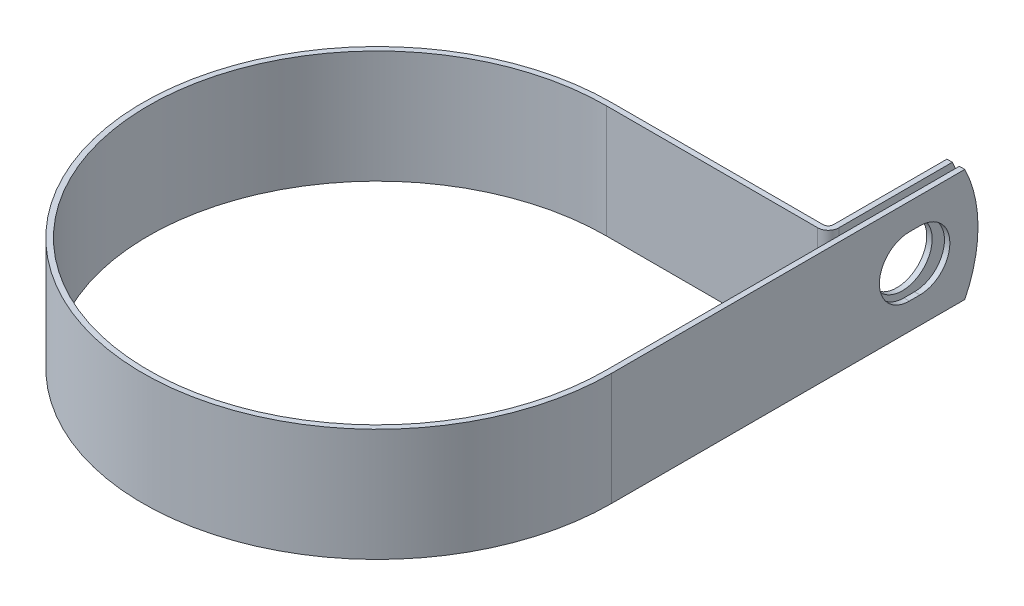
ISO-10303-21;
HEADER;
FILE_DESCRIPTION(('STEP AP214'),'2;1');
FILE_NAME('part.step','',(''),(''),'','','');
FILE_SCHEMA(('AUTOMOTIVE_DESIGN { 1 0 10303 214 1 1 1 1 }'));
ENDSEC;
DATA;
#1=APPLICATION_CONTEXT('core data for automotive mechanical design processes');
#2=APPLICATION_PROTOCOL_DEFINITION('international standard','automotive_design',2000,#1);
#3=PRODUCT_CONTEXT('',#1,'mechanical');
#4=PRODUCT('Part','Part','',(#3));
#5=PRODUCT_RELATED_PRODUCT_CATEGORY('part','',(#4));
#6=PRODUCT_DEFINITION_FORMATION('','',#4);
#7=PRODUCT_DEFINITION_CONTEXT('part definition',#1,'design');
#8=PRODUCT_DEFINITION('design','',#6,#7);
#9=PRODUCT_DEFINITION_SHAPE('','',#8);
#10=(LENGTH_UNIT() NAMED_UNIT(*) SI_UNIT(.MILLI.,.METRE.));
#11=(NAMED_UNIT(*) PLANE_ANGLE_UNIT() SI_UNIT($,.RADIAN.));
#12=(NAMED_UNIT(*) SI_UNIT($,.STERADIAN.) SOLID_ANGLE_UNIT());
#13=UNCERTAINTY_MEASURE_WITH_UNIT(LENGTH_MEASURE(1.E-05),#10,'distance_accuracy_value','');
#14=(GEOMETRIC_REPRESENTATION_CONTEXT(3) GLOBAL_UNCERTAINTY_ASSIGNED_CONTEXT((#13)) GLOBAL_UNIT_ASSIGNED_CONTEXT((#10,
#11,#12)) REPRESENTATION_CONTEXT('',''));
#15=CARTESIAN_POINT('',(0.,0.,0.));
#16=DIRECTION('',(0.,0.,1.));
#17=DIRECTION('',(1.,0.,0.));
#18=AXIS2_PLACEMENT_3D('',#15,#16,#17);
#19=CARTESIAN_POINT('',(51.5874,12.7,0.));
#20=DIRECTION('',(-1.,0.,0.));
#21=DIRECTION('',(0.,0.,1.));
#22=AXIS2_PLACEMENT_3D('',#19,#20,#21);
#23=PLANE('',#22);
#24=DIRECTION('',(0.,0.,-1.));
#25=VECTOR('',#24,1.);
#26=CARTESIAN_POINT('',(51.5874,-6.7437,-67.0559999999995));
#27=LINE('',#26,#25);
#28=CARTESIAN_POINT('',(51.5874,-6.7437,-67.0559999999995));
#29=VERTEX_POINT('',#28);
#30=CARTESIAN_POINT('',(51.5874,-6.7437,-69.4436000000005));
#31=VERTEX_POINT('',#30);
#32=EDGE_CURVE('E218',#29,#31,#27,.T.);
#33=ORIENTED_EDGE('',*,*,#32,.T.);
#34=CARTESIAN_POINT('',(51.5874,0.,-69.4435999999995));
#35=DIRECTION('',(-1.,0.,0.));
#36=DIRECTION('',(0.,0.,1.));
#37=AXIS2_PLACEMENT_3D('',#34,#35,#36);
#38=CIRCLE('',#37,6.7437);
#39=CARTESIAN_POINT('',(51.5874,6.7437,-69.4436000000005));
#40=VERTEX_POINT('',#39);
#41=EDGE_CURVE('E239',#31,#40,#38,.F.);
#42=ORIENTED_EDGE('',*,*,#41,.T.);
#43=DIRECTION('',(0.,0.,1.));
#44=VECTOR('',#43,1.);
#45=CARTESIAN_POINT('',(51.5874,6.7437,-67.0559999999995));
#46=LINE('',#45,#44);
#47=CARTESIAN_POINT('',(51.5874,6.7437,-67.0559999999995));
#48=VERTEX_POINT('',#47);
#49=EDGE_CURVE('E235',#40,#48,#46,.T.);
#50=ORIENTED_EDGE('',*,*,#49,.T.);
#51=CARTESIAN_POINT('',(51.5874,0.,-67.0559999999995));
#52=DIRECTION('',(-1.,0.,0.));
#53=DIRECTION('',(0.,0.,1.));
#54=AXIS2_PLACEMENT_3D('',#51,#52,#53);
#55=CIRCLE('',#54,6.7437);
#56=EDGE_CURVE('E230',#48,#29,#55,.F.);
#57=ORIENTED_EDGE('',*,*,#56,.T.);
#58=EDGE_LOOP('',(#33,#42,#50,#57));
#59=FACE_BOUND('',#58,.T.);
#60=CARTESIAN_POINT('',(51.5874,0.,-53.9496));
#61=DIRECTION('',(-1.,0.,0.));
#62=DIRECTION('',(0.,0.,1.));
#63=AXIS2_PLACEMENT_3D('',#60,#61,#62);
#64=CIRCLE('',#63,28.575);
#65=CARTESIAN_POINT('',(51.5874,12.7,-79.5472683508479));
#66=VERTEX_POINT('',#65);
#67=CARTESIAN_POINT('',(51.5874,-12.7,-79.5472683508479));
#68=VERTEX_POINT('',#67);
#69=EDGE_CURVE('E57',#66,#68,#64,.T.);
#70=ORIENTED_EDGE('',*,*,#69,.T.);
#71=DIRECTION('',(0.,0.,-1.));
#72=VECTOR('',#71,1.);
#73=CARTESIAN_POINT('',(51.5874,-12.7,0.));
#74=LINE('',#73,#72);
#75=CARTESIAN_POINT('',(51.5874,-12.7,0.));
#76=VERTEX_POINT('',#75);
#77=EDGE_CURVE('E253',#76,#68,#74,.T.);
#78=ORIENTED_EDGE('',*,*,#77,.F.);
#79=DIRECTION('',(0.,-1.,0.));
#80=VECTOR('',#79,1.);
#81=CARTESIAN_POINT('',(51.5874,12.7,0.));
#82=LINE('',#81,#80);
#83=CARTESIAN_POINT('',(51.5874,12.7,0.));
#84=VERTEX_POINT('',#83);
#85=EDGE_CURVE('E200',#84,#76,#82,.T.);
#86=ORIENTED_EDGE('',*,*,#85,.F.);
#87=DIRECTION('',(0.,0.,-1.));
#88=VECTOR('',#87,1.);
#89=CARTESIAN_POINT('',(51.5874,12.7,-51.5874));
#90=LINE('',#89,#88);
#91=EDGE_CURVE('E255',#84,#66,#90,.T.);
#92=ORIENTED_EDGE('',*,*,#91,.T.);
#93=EDGE_LOOP('',(#70,#78,#86,#92));
#94=FACE_BOUND('',#93,.T.);
#95=ADVANCED_FACE('F36',(#59,#94),#23,.T.);
#96=CARTESIAN_POINT('',(50.0126,12.7,-82.5246));
#97=DIRECTION('',(1.,0.,0.));
#98=DIRECTION('',(0.,0.,-1.));
#99=AXIS2_PLACEMENT_3D('',#96,#97,#98);
#100=PLANE('',#99);
#101=CARTESIAN_POINT('',(50.0126,0.,-68.2498));
#102=DIRECTION('',(1.,0.,0.));
#103=DIRECTION('',(0.,0.,-1.));
#104=AXIS2_PLACEMENT_3D('',#101,#102,#103);
#105=CIRCLE('',#104,6.7437);
#106=CARTESIAN_POINT('',(50.0126,0.,-61.5061));
#107=VERTEX_POINT('',#106);
#108=EDGE_CURVE('E250',#107,#107,#105,.F.);
#109=ORIENTED_EDGE('',*,*,#108,.T.);
#110=EDGE_LOOP('',(#109));
#111=FACE_BOUND('',#110,.T.);
#112=DIRECTION('',(0.,0.,1.));
#113=VECTOR('',#112,1.);
#114=CARTESIAN_POINT('',(50.0126,-12.7,-82.5246));
#115=LINE('',#114,#113);
#116=CARTESIAN_POINT('',(50.0126,-12.7,-79.5472683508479));
#117=VERTEX_POINT('',#116);
#118=CARTESIAN_POINT('',(50.0126,-12.7,-53.96484));
#119=VERTEX_POINT('',#118);
#120=EDGE_CURVE('E166',#117,#119,#115,.T.);
#121=ORIENTED_EDGE('',*,*,#120,.F.);
#122=CARTESIAN_POINT('',(50.0126,0.,-53.9496));
#123=DIRECTION('',(1.,0.,0.));
#124=DIRECTION('',(0.,0.,-1.));
#125=AXIS2_PLACEMENT_3D('',#122,#123,#124);
#126=CIRCLE('',#125,28.575);
#127=CARTESIAN_POINT('',(50.0126,12.7,-79.5472683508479));
#128=VERTEX_POINT('',#127);
#129=EDGE_CURVE('E158',#117,#128,#126,.T.);
#130=ORIENTED_EDGE('',*,*,#129,.T.);
#131=DIRECTION('',(0.,0.,1.));
#132=VECTOR('',#131,1.);
#133=CARTESIAN_POINT('',(50.0126,12.7,-82.5246));
#134=LINE('',#133,#132);
#135=CARTESIAN_POINT('',(50.0126,12.7,-53.96484));
#136=VERTEX_POINT('',#135);
#137=EDGE_CURVE('E206',#128,#136,#134,.T.);
#138=ORIENTED_EDGE('',*,*,#137,.T.);
#139=DIRECTION('',(0.,-1.,0.));
#140=VECTOR('',#139,1.);
#141=CARTESIAN_POINT('',(50.0126,12.7,-53.96484));
#142=LINE('',#141,#140);
#143=EDGE_CURVE('E193',#136,#119,#142,.T.);
#144=ORIENTED_EDGE('',*,*,#143,.T.);
#145=EDGE_LOOP('',(#121,#130,#138,#144));
#146=FACE_BOUND('',#145,.T.);
#147=ADVANCED_FACE('F208',(#111,#146),#100,.T.);
#148=CARTESIAN_POINT('',(48.7934,12.7,-82.5246));
#149=DIRECTION('',(1.,0.,0.));
#150=DIRECTION('',(0.,0.,-1.));
#151=AXIS2_PLACEMENT_3D('',#148,#149,#150);
#152=PLANE('',#151);
#153=CARTESIAN_POINT('',(48.7934,0.,-68.2498));
#154=DIRECTION('',(-1.,0.,0.));
#155=DIRECTION('',(0.,0.,1.));
#156=AXIS2_PLACEMENT_3D('',#153,#154,#155);
#157=CIRCLE('',#156,6.7437);
#158=CARTESIAN_POINT('',(48.7934,0.,-61.5061));
#159=VERTEX_POINT('',#158);
#160=EDGE_CURVE('E247',#159,#159,#157,.T.);
#161=ORIENTED_EDGE('',*,*,#160,.F.);
#162=EDGE_LOOP('',(#161));
#163=FACE_BOUND('',#162,.T.);
#164=CARTESIAN_POINT('',(48.7934,0.,-53.9496));
#165=DIRECTION('',(-1.,0.,0.));
#166=DIRECTION('',(0.,0.,1.));
#167=AXIS2_PLACEMENT_3D('',#164,#165,#166);
#168=CIRCLE('',#167,28.575);
#169=CARTESIAN_POINT('',(48.7934,12.7,-79.5472683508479));
#170=VERTEX_POINT('',#169);
#171=CARTESIAN_POINT('',(48.7934,-12.7,-79.5472683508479));
#172=VERTEX_POINT('',#171);
#173=EDGE_CURVE('E49',#170,#172,#168,.T.);
#174=ORIENTED_EDGE('',*,*,#173,.T.);
#175=DIRECTION('',(0.,0.,1.));
#176=VECTOR('',#175,1.);
#177=CARTESIAN_POINT('',(48.7934,-12.7,-82.5246));
#178=LINE('',#177,#176);
#179=CARTESIAN_POINT('',(48.7934,-12.7,-53.96484));
#180=VERTEX_POINT('',#179);
#181=EDGE_CURVE('E149',#172,#180,#178,.T.);
#182=ORIENTED_EDGE('',*,*,#181,.T.);
#183=DIRECTION('',(0.,-1.,0.));
#184=VECTOR('',#183,1.);
#185=CARTESIAN_POINT('',(48.7934,12.7,-53.96484));
#186=LINE('',#185,#184);
#187=CARTESIAN_POINT('',(48.7934,12.7,-53.96484));
#188=VERTEX_POINT('',#187);
#189=EDGE_CURVE('E191',#188,#180,#186,.T.);
#190=ORIENTED_EDGE('',*,*,#189,.F.);
#191=DIRECTION('',(0.,0.,1.));
#192=VECTOR('',#191,1.);
#193=CARTESIAN_POINT('',(48.7934,12.7,-82.5246));
#194=LINE('',#193,#192);
#195=EDGE_CURVE('E151',#170,#188,#194,.T.);
#196=ORIENTED_EDGE('',*,*,#195,.F.);
#197=EDGE_LOOP('',(#174,#182,#190,#196));
#198=FACE_BOUND('',#197,.T.);
#199=ADVANCED_FACE('F146',(#163,#198),#152,.F.);
#200=CARTESIAN_POINT('',(52.8066,12.7,0.));
#201=DIRECTION('',(-1.,0.,0.));
#202=DIRECTION('',(0.,0.,1.));
#203=AXIS2_PLACEMENT_3D('',#200,#201,#202);
#204=PLANE('',#203);
#205=CARTESIAN_POINT('',(52.8066,0.,-69.4435999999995));
#206=DIRECTION('',(1.,0.,0.));
#207=DIRECTION('',(0.,0.,-1.));
#208=AXIS2_PLACEMENT_3D('',#205,#206,#207);
#209=CIRCLE('',#208,6.7437);
#210=CARTESIAN_POINT('',(52.8066,-6.7437,-69.4436000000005));
#211=VERTEX_POINT('',#210);
#212=CARTESIAN_POINT('',(52.8066,6.7437,-69.4436000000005));
#213=VERTEX_POINT('',#212);
#214=EDGE_CURVE('E219',#211,#213,#209,.T.);
#215=ORIENTED_EDGE('',*,*,#214,.F.);
#216=DIRECTION('',(0.,0.,-1.));
#217=VECTOR('',#216,1.);
#218=CARTESIAN_POINT('',(52.8066,-6.7437,-67.0559999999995));
#219=LINE('',#218,#217);
#220=CARTESIAN_POINT('',(52.8066,-6.7437,-67.0559999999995));
#221=VERTEX_POINT('',#220);
#222=EDGE_CURVE('E222',#221,#211,#219,.T.);
#223=ORIENTED_EDGE('',*,*,#222,.F.);
#224=CARTESIAN_POINT('',(52.8066,0.,-67.0559999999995));
#225=DIRECTION('',(1.,0.,0.));
#226=DIRECTION('',(0.,0.,-1.));
#227=AXIS2_PLACEMENT_3D('',#224,#225,#226);
#228=CIRCLE('',#227,6.7437);
#229=CARTESIAN_POINT('',(52.8066,6.7437,-67.0559999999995));
#230=VERTEX_POINT('',#229);
#231=EDGE_CURVE('E212',#230,#221,#228,.T.);
#232=ORIENTED_EDGE('',*,*,#231,.F.);
#233=DIRECTION('',(0.,0.,1.));
#234=VECTOR('',#233,1.);
#235=CARTESIAN_POINT('',(52.8066,6.7437,-67.0559999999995));
#236=LINE('',#235,#234);
#237=EDGE_CURVE('E216',#213,#230,#236,.T.);
#238=ORIENTED_EDGE('',*,*,#237,.F.);
#239=EDGE_LOOP('',(#215,#223,#232,#238));
#240=FACE_BOUND('',#239,.T.);
#241=DIRECTION('',(0.,0.,-1.));
#242=VECTOR('',#241,1.);
#243=CARTESIAN_POINT('',(52.8066,-12.7,0.));
#244=LINE('',#243,#242);
#245=CARTESIAN_POINT('',(52.8066,-12.7,0.));
#246=VERTEX_POINT('',#245);
#247=CARTESIAN_POINT('',(52.8066,-12.7,-79.5472683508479));
#248=VERTEX_POINT('',#247);
#249=EDGE_CURVE('E177',#246,#248,#244,.T.);
#250=ORIENTED_EDGE('',*,*,#249,.T.);
#251=CARTESIAN_POINT('',(52.8066,0.,-53.9496));
#252=DIRECTION('',(-1.,0.,0.));
#253=DIRECTION('',(0.,0.,1.));
#254=AXIS2_PLACEMENT_3D('',#251,#252,#253);
#255=CIRCLE('',#254,28.575);
#256=CARTESIAN_POINT('',(52.8066,12.7,-79.5472683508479));
#257=VERTEX_POINT('',#256);
#258=EDGE_CURVE('E152',#257,#248,#255,.T.);
#259=ORIENTED_EDGE('',*,*,#258,.F.);
#260=DIRECTION('',(0.,0.,-1.));
#261=VECTOR('',#260,1.);
#262=CARTESIAN_POINT('',(52.8066,12.7,-51.5874));
#263=LINE('',#262,#261);
#264=CARTESIAN_POINT('',(52.8066,12.7,0.));
#265=VERTEX_POINT('',#264);
#266=EDGE_CURVE('E180',#265,#257,#263,.T.);
#267=ORIENTED_EDGE('',*,*,#266,.F.);
#268=DIRECTION('',(0.,-1.,0.));
#269=VECTOR('',#268,1.);
#270=CARTESIAN_POINT('',(52.8066,12.7,0.));
#271=LINE('',#270,#269);
#272=EDGE_CURVE('E181',#265,#246,#271,.T.);
#273=ORIENTED_EDGE('',*,*,#272,.T.);
#274=EDGE_LOOP('',(#250,#259,#267,#273));
#275=FACE_BOUND('',#274,.T.);
#276=ADVANCED_FACE('F303',(#240,#275),#204,.F.);
#277=CARTESIAN_POINT('',(0.,-12.7,0.));
#278=DIRECTION('',(0.,1.,0.));
#279=DIRECTION('',(1.,0.,0.));
#280=AXIS2_PLACEMENT_3D('',#277,#278,#279);
#281=PLANE('',#280);
#282=DIRECTION('',(-1.,0.,0.));
#283=VECTOR('',#282,1.);
#284=CARTESIAN_POINT('',(52.8066,-12.7,-79.5472683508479));
#285=LINE('',#284,#283);
#286=EDGE_CURVE('E153',#248,#68,#285,.T.);
#287=ORIENTED_EDGE('',*,*,#286,.F.);
#288=ORIENTED_EDGE('',*,*,#249,.F.);
#289=CARTESIAN_POINT('',(0.,-12.7,0.));
#290=DIRECTION('',(0.,1.,0.));
#291=DIRECTION('',(1.,0.,0.));
#292=AXIS2_PLACEMENT_3D('',#289,#290,#291);
#293=CIRCLE('',#292,52.8066);
#294=CARTESIAN_POINT('',(0.,-12.7,-52.8066));
#295=VERTEX_POINT('',#294);
#296=EDGE_CURVE('E175',#295,#246,#293,.T.);
#297=ORIENTED_EDGE('',*,*,#296,.F.);
#298=DIRECTION('',(1.,0.,0.));
#299=VECTOR('',#298,1.);
#300=CARTESIAN_POINT('',(0.,-12.7,-52.8066));
#301=LINE('',#300,#299);
#302=CARTESIAN_POINT('',(47.63516,-12.7,-52.8066));
#303=VERTEX_POINT('',#302);
#304=EDGE_CURVE('E168',#303,#295,#301,.F.);
#305=ORIENTED_EDGE('',*,*,#304,.F.);
#306=CARTESIAN_POINT('',(47.63516,-12.7,-53.96484));
#307=DIRECTION('',(0.,1.,0.));
#308=DIRECTION('',(1.,0.,0.));
#309=AXIS2_PLACEMENT_3D('',#306,#307,#308);
#310=CIRCLE('',#309,1.15824000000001);
#311=EDGE_CURVE('E165',#180,#303,#310,.F.);
#312=ORIENTED_EDGE('',*,*,#311,.F.);
#313=ORIENTED_EDGE('',*,*,#181,.F.);
#314=DIRECTION('',(-1.,0.,0.));
#315=VECTOR('',#314,1.);
#316=CARTESIAN_POINT('',(52.8066,-12.7,-79.5472683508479));
#317=LINE('',#316,#315);
#318=EDGE_CURVE('E11',#117,#172,#317,.T.);
#319=ORIENTED_EDGE('',*,*,#318,.F.);
#320=ORIENTED_EDGE('',*,*,#120,.T.);
#321=CARTESIAN_POINT('',(47.63516,-12.7,-53.96484));
#322=DIRECTION('',(0.,-1.,0.));
#323=DIRECTION('',(0.,0.,1.));
#324=AXIS2_PLACEMENT_3D('',#321,#322,#323);
#325=CIRCLE('',#324,2.37744);
#326=CARTESIAN_POINT('',(47.63516,-12.7,-51.5874));
#327=VERTEX_POINT('',#326);
#328=EDGE_CURVE('E170',#119,#327,#325,.T.);
#329=ORIENTED_EDGE('',*,*,#328,.T.);
#330=DIRECTION('',(-1.,0.,0.));
#331=VECTOR('',#330,1.);
#332=CARTESIAN_POINT('',(0.,-12.7,-51.5874));
#333=LINE('',#332,#331);
#334=CARTESIAN_POINT('',(0.,-12.7,-51.5874));
#335=VERTEX_POINT('',#334);
#336=EDGE_CURVE('E280',#327,#335,#333,.T.);
#337=ORIENTED_EDGE('',*,*,#336,.T.);
#338=CARTESIAN_POINT('',(0.,-12.7,0.));
#339=DIRECTION('',(0.,1.,0.));
#340=DIRECTION('',(0.,0.,1.));
#341=AXIS2_PLACEMENT_3D('',#338,#339,#340);
#342=CIRCLE('',#341,51.5874);
#343=EDGE_CURVE('E277',#335,#76,#342,.T.);
#344=ORIENTED_EDGE('',*,*,#343,.T.);
#345=ORIENTED_EDGE('',*,*,#77,.T.);
#346=EDGE_LOOP('',(#287,#288,#297,#305,#312,#313,#319,#320,#329,#337,#344,#345));
#347=FACE_BOUND('',#346,.T.);
#348=ADVANCED_FACE('F163',(#347),#281,.F.);
#349=CARTESIAN_POINT('',(0.,12.7,0.));
#350=DIRECTION('',(0.,1.,0.));
#351=DIRECTION('',(1.,0.,0.));
#352=AXIS2_PLACEMENT_3D('',#349,#350,#351);
#353=PLANE('',#352);
#354=ORIENTED_EDGE('',*,*,#266,.T.);
#355=DIRECTION('',(-1.,0.,0.));
#356=VECTOR('',#355,1.);
#357=CARTESIAN_POINT('',(52.8066,12.7,-79.5472683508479));
#358=LINE('',#357,#356);
#359=EDGE_CURVE('E210',#257,#66,#358,.T.);
#360=ORIENTED_EDGE('',*,*,#359,.T.);
#361=ORIENTED_EDGE('',*,*,#91,.F.);
#362=CARTESIAN_POINT('',(0.,12.7,0.));
#363=DIRECTION('',(0.,1.,0.));
#364=DIRECTION('',(0.,0.,1.));
#365=AXIS2_PLACEMENT_3D('',#362,#363,#364);
#366=CIRCLE('',#365,51.5874);
#367=CARTESIAN_POINT('',(0.,12.7,-51.5874));
#368=VERTEX_POINT('',#367);
#369=EDGE_CURVE('E258',#368,#84,#366,.T.);
#370=ORIENTED_EDGE('',*,*,#369,.F.);
#371=DIRECTION('',(-1.,0.,0.));
#372=VECTOR('',#371,1.);
#373=CARTESIAN_POINT('',(0.,12.7,-51.5874));
#374=LINE('',#373,#372);
#375=CARTESIAN_POINT('',(47.63516,12.7,-51.5874));
#376=VERTEX_POINT('',#375);
#377=EDGE_CURVE('E261',#376,#368,#374,.T.);
#378=ORIENTED_EDGE('',*,*,#377,.F.);
#379=CARTESIAN_POINT('',(47.63516,12.7,-53.96484));
#380=DIRECTION('',(0.,-1.,0.));
#381=DIRECTION('',(0.,0.,1.));
#382=AXIS2_PLACEMENT_3D('',#379,#380,#381);
#383=CIRCLE('',#382,2.37744);
#384=EDGE_CURVE('E264',#136,#376,#383,.T.);
#385=ORIENTED_EDGE('',*,*,#384,.F.);
#386=ORIENTED_EDGE('',*,*,#137,.F.);
#387=DIRECTION('',(-1.,0.,0.));
#388=VECTOR('',#387,1.);
#389=CARTESIAN_POINT('',(52.8066,12.7,-79.5472683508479));
#390=LINE('',#389,#388);
#391=EDGE_CURVE('E43',#128,#170,#390,.T.);
#392=ORIENTED_EDGE('',*,*,#391,.T.);
#393=ORIENTED_EDGE('',*,*,#195,.T.);
#394=CARTESIAN_POINT('',(47.63516,12.7,-53.96484));
#395=DIRECTION('',(0.,1.,0.));
#396=DIRECTION('',(1.,0.,0.));
#397=AXIS2_PLACEMENT_3D('',#394,#395,#396);
#398=CIRCLE('',#397,1.15824000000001);
#399=CARTESIAN_POINT('',(47.63516,12.7,-52.8066));
#400=VERTEX_POINT('',#399);
#401=EDGE_CURVE('E269',#188,#400,#398,.F.);
#402=ORIENTED_EDGE('',*,*,#401,.T.);
#403=DIRECTION('',(1.,0.,0.));
#404=VECTOR('',#403,1.);
#405=CARTESIAN_POINT('',(0.,12.7,-52.8066));
#406=LINE('',#405,#404);
#407=CARTESIAN_POINT('',(0.,12.7,-52.8066));
#408=VERTEX_POINT('',#407);
#409=EDGE_CURVE('E271',#400,#408,#406,.F.);
#410=ORIENTED_EDGE('',*,*,#409,.T.);
#411=CARTESIAN_POINT('',(0.,12.7,0.));
#412=DIRECTION('',(0.,1.,0.));
#413=DIRECTION('',(1.,0.,0.));
#414=AXIS2_PLACEMENT_3D('',#411,#412,#413);
#415=CIRCLE('',#414,52.8066);
#416=EDGE_CURVE('E185',#408,#265,#415,.T.);
#417=ORIENTED_EDGE('',*,*,#416,.T.);
#418=EDGE_LOOP('',(#354,#360,#361,#370,#378,#385,#386,#392,#393,#402,#410,#417));
#419=FACE_BOUND('',#418,.T.);
#420=ADVANCED_FACE('F204',(#419),#353,.T.);
#421=CARTESIAN_POINT('',(0.,12.7,0.));
#422=DIRECTION('',(0.,-1.,0.));
#423=DIRECTION('',(0.,0.,-1.));
#424=AXIS2_PLACEMENT_3D('',#421,#422,#423);
#425=CYLINDRICAL_SURFACE('',#424,51.5874);
#426=ORIENTED_EDGE('',*,*,#343,.F.);
#427=DIRECTION('',(0.,-1.,0.));
#428=VECTOR('',#427,1.);
#429=CARTESIAN_POINT('',(0.,12.7,-51.5874));
#430=LINE('',#429,#428);
#431=EDGE_CURVE('E198',#368,#335,#430,.T.);
#432=ORIENTED_EDGE('',*,*,#431,.F.);
#433=ORIENTED_EDGE('',*,*,#369,.T.);
#434=ORIENTED_EDGE('',*,*,#85,.T.);
#435=EDGE_LOOP('',(#426,#432,#433,#434));
#436=FACE_BOUND('',#435,.T.);
#437=ADVANCED_FACE('F293',(#436),#425,.F.);
#438=CARTESIAN_POINT('',(0.,12.7,-51.5874));
#439=DIRECTION('',(0.,0.,1.));
#440=DIRECTION('',(1.,0.,0.));
#441=AXIS2_PLACEMENT_3D('',#438,#439,#440);
#442=PLANE('',#441);
#443=ORIENTED_EDGE('',*,*,#336,.F.);
#444=DIRECTION('',(0.,-1.,0.));
#445=VECTOR('',#444,1.);
#446=CARTESIAN_POINT('',(47.63516,12.7,-51.5874));
#447=LINE('',#446,#445);
#448=EDGE_CURVE('E196',#376,#327,#447,.T.);
#449=ORIENTED_EDGE('',*,*,#448,.F.);
#450=ORIENTED_EDGE('',*,*,#377,.T.);
#451=ORIENTED_EDGE('',*,*,#431,.T.);
#452=EDGE_LOOP('',(#443,#449,#450,#451));
#453=FACE_BOUND('',#452,.T.);
#454=ADVANCED_FACE('F289',(#453),#442,.T.);
#455=CARTESIAN_POINT('',(47.63516,12.7,-53.96484));
#456=DIRECTION('',(0.,-1.,0.));
#457=DIRECTION('',(0.,0.,-1.));
#458=AXIS2_PLACEMENT_3D('',#455,#456,#457);
#459=CYLINDRICAL_SURFACE('',#458,2.37744);
#460=ORIENTED_EDGE('',*,*,#328,.F.);
#461=ORIENTED_EDGE('',*,*,#143,.F.);
#462=ORIENTED_EDGE('',*,*,#384,.T.);
#463=ORIENTED_EDGE('',*,*,#448,.T.);
#464=EDGE_LOOP('',(#460,#461,#462,#463));
#465=FACE_BOUND('',#464,.T.);
#466=ADVANCED_FACE('F286',(#465),#459,.T.);
#467=CARTESIAN_POINT('',(47.63516,12.7,-53.96484));
#468=DIRECTION('',(0.,-1.,0.));
#469=DIRECTION('',(0.,0.,-1.));
#470=AXIS2_PLACEMENT_3D('',#467,#468,#469);
#471=CYLINDRICAL_SURFACE('',#470,1.15824000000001);
#472=ORIENTED_EDGE('',*,*,#311,.T.);
#473=DIRECTION('',(0.,-1.,0.));
#474=VECTOR('',#473,1.);
#475=CARTESIAN_POINT('',(47.63516,12.7,-52.8066));
#476=LINE('',#475,#474);
#477=EDGE_CURVE('E188',#400,#303,#476,.T.);
#478=ORIENTED_EDGE('',*,*,#477,.F.);
#479=ORIENTED_EDGE('',*,*,#401,.F.);
#480=ORIENTED_EDGE('',*,*,#189,.T.);
#481=EDGE_LOOP('',(#472,#478,#479,#480));
#482=FACE_BOUND('',#481,.T.);
#483=ADVANCED_FACE('F316',(#482),#471,.F.);
#484=CARTESIAN_POINT('',(0.,12.7,-52.8066));
#485=DIRECTION('',(0.,0.,1.));
#486=DIRECTION('',(1.,0.,0.));
#487=AXIS2_PLACEMENT_3D('',#484,#485,#486);
#488=PLANE('',#487);
#489=ORIENTED_EDGE('',*,*,#304,.T.);
#490=DIRECTION('',(0.,-1.,0.));
#491=VECTOR('',#490,1.);
#492=CARTESIAN_POINT('',(0.,12.7,-52.8066));
#493=LINE('',#492,#491);
#494=EDGE_CURVE('E184',#408,#295,#493,.T.);
#495=ORIENTED_EDGE('',*,*,#494,.F.);
#496=ORIENTED_EDGE('',*,*,#409,.F.);
#497=ORIENTED_EDGE('',*,*,#477,.T.);
#498=EDGE_LOOP('',(#489,#495,#496,#497));
#499=FACE_BOUND('',#498,.T.);
#500=ADVANCED_FACE('F312',(#499),#488,.F.);
#501=CARTESIAN_POINT('',(0.,12.7,0.));
#502=DIRECTION('',(0.,-1.,0.));
#503=DIRECTION('',(0.,0.,-1.));
#504=AXIS2_PLACEMENT_3D('',#501,#502,#503);
#505=CYLINDRICAL_SURFACE('',#504,52.8066);
#506=ORIENTED_EDGE('',*,*,#296,.T.);
#507=ORIENTED_EDGE('',*,*,#272,.F.);
#508=ORIENTED_EDGE('',*,*,#416,.F.);
#509=ORIENTED_EDGE('',*,*,#494,.T.);
#510=EDGE_LOOP('',(#506,#507,#508,#509));
#511=FACE_BOUND('',#510,.T.);
#512=ADVANCED_FACE('F309',(#511),#505,.T.);
#513=CARTESIAN_POINT('',(69.0866640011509,0.,-68.2498));
#514=DIRECTION('',(-1.,0.,0.));
#515=DIRECTION('',(0.,0.,1.));
#516=AXIS2_PLACEMENT_3D('',#513,#514,#515);
#517=CYLINDRICAL_SURFACE('',#516,6.7437);
#518=CARTESIAN_POINT('',(48.7934,0.,-61.5061));
#519=CARTESIAN_POINT('',(48.8061,0.,-61.5061));
#520=CARTESIAN_POINT('',(48.8188,0.,-61.5061));
#521=CARTESIAN_POINT('',(48.8442,0.,-61.5061));
#522=CARTESIAN_POINT('',(48.8569,0.,-61.5061));
#523=CARTESIAN_POINT('',(48.8823,0.,-61.5061));
#524=CARTESIAN_POINT('',(48.895,0.,-61.5061));
#525=CARTESIAN_POINT('',(48.9204,0.,-61.5061));
#526=CARTESIAN_POINT('',(48.9331,0.,-61.5061));
#527=CARTESIAN_POINT('',(48.9585,0.,-61.5061));
#528=CARTESIAN_POINT('',(48.9712,0.,-61.5061));
#529=CARTESIAN_POINT('',(48.9966,0.,-61.5061));
#530=CARTESIAN_POINT('',(49.0093,0.,-61.5061));
#531=CARTESIAN_POINT('',(49.0347,0.,-61.5061));
#532=CARTESIAN_POINT('',(49.0474,0.,-61.5061));
#533=CARTESIAN_POINT('',(49.0728,0.,-61.5061));
#534=CARTESIAN_POINT('',(49.0855,0.,-61.5061));
#535=CARTESIAN_POINT('',(49.1109,0.,-61.5061));
#536=CARTESIAN_POINT('',(49.1236,0.,-61.5061));
#537=CARTESIAN_POINT('',(49.149,0.,-61.5061));
#538=CARTESIAN_POINT('',(49.1617,0.,-61.5061));
#539=CARTESIAN_POINT('',(49.1871,0.,-61.5061));
#540=CARTESIAN_POINT('',(49.1998,0.,-61.5061));
#541=CARTESIAN_POINT('',(49.2252,0.,-61.5061));
#542=CARTESIAN_POINT('',(49.2379,0.,-61.5061));
#543=CARTESIAN_POINT('',(49.2633,0.,-61.5061));
#544=CARTESIAN_POINT('',(49.276,0.,-61.5061));
#545=CARTESIAN_POINT('',(49.3014,0.,-61.5061));
#546=CARTESIAN_POINT('',(49.3141,0.,-61.5061));
#547=CARTESIAN_POINT('',(49.3395,0.,-61.5061));
#548=CARTESIAN_POINT('',(49.3522,0.,-61.5061));
#549=CARTESIAN_POINT('',(49.3776,0.,-61.5061));
#550=CARTESIAN_POINT('',(49.3903,0.,-61.5061));
#551=CARTESIAN_POINT('',(49.4157,0.,-61.5061));
#552=CARTESIAN_POINT('',(49.4284,0.,-61.5061));
#553=CARTESIAN_POINT('',(49.4538,0.,-61.5061));
#554=CARTESIAN_POINT('',(49.4665,0.,-61.5061));
#555=CARTESIAN_POINT('',(49.4919,0.,-61.5061));
#556=CARTESIAN_POINT('',(49.5046,0.,-61.5061));
#557=CARTESIAN_POINT('',(49.53,0.,-61.5061));
#558=CARTESIAN_POINT('',(49.5427,0.,-61.5061));
#559=CARTESIAN_POINT('',(49.5681,0.,-61.5061));
#560=CARTESIAN_POINT('',(49.5808,0.,-61.5061));
#561=CARTESIAN_POINT('',(49.6062,0.,-61.5061));
#562=CARTESIAN_POINT('',(49.6189,0.,-61.5061));
#563=CARTESIAN_POINT('',(49.6443,0.,-61.5061));
#564=CARTESIAN_POINT('',(49.657,0.,-61.5061));
#565=CARTESIAN_POINT('',(49.6824,0.,-61.5061));
#566=CARTESIAN_POINT('',(49.6951,0.,-61.5061));
#567=CARTESIAN_POINT('',(49.7205,0.,-61.5061));
#568=CARTESIAN_POINT('',(49.7332,0.,-61.5061));
#569=CARTESIAN_POINT('',(49.7586,0.,-61.5061));
#570=CARTESIAN_POINT('',(49.7713,0.,-61.5061));
#571=CARTESIAN_POINT('',(49.7967,0.,-61.5061));
#572=CARTESIAN_POINT('',(49.8094,0.,-61.5061));
#573=CARTESIAN_POINT('',(49.8348,0.,-61.5061));
#574=CARTESIAN_POINT('',(49.8475,0.,-61.5061));
#575=CARTESIAN_POINT('',(49.8729,0.,-61.5061));
#576=CARTESIAN_POINT('',(49.8856,0.,-61.5061));
#577=CARTESIAN_POINT('',(49.911,0.,-61.5061));
#578=CARTESIAN_POINT('',(49.9237,0.,-61.5061));
#579=CARTESIAN_POINT('',(49.9491,0.,-61.5061));
#580=CARTESIAN_POINT('',(49.9618,0.,-61.5061));
#581=CARTESIAN_POINT('',(49.9872,0.,-61.5061));
#582=CARTESIAN_POINT('',(49.9999,0.,-61.5061));
#583=CARTESIAN_POINT('',(50.0126,0.,-61.5061));
#584=B_SPLINE_CURVE_WITH_KNOTS('',3,(#518,#519,#520,#521,#522,#523,#524,#525,#526,#527,#528,
#529,#530,#531,#532,#533,#534,#535,#536,#537,#538,#539,#540,#541,#542,#543,#544,#545,#546,#547,
#548,#549,#550,#551,#552,#553,#554,#555,#556,#557,#558,#559,#560,#561,#562,#563,#564,#565,#566,
#567,#568,#569,#570,#571,#572,#573,#574,#575,#576,#577,#578,#579,#580,#581,#582,#583),
.UNSPECIFIED.,.F.,.F.,(4,2,2,2,2,2,2,2,2,2,2,2,2,2,2,2,2,2,2,2,2,2,2,2,2,2,2,2,2,2,2,2,4),(0.,
0.0380999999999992,0.0761999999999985,0.114299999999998,0.152399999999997,0.190499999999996,
0.228599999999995,0.266699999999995,0.304799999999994,0.342899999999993,0.380999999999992,
0.419099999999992,0.457199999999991,0.49529999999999,0.533399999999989,0.571499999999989,
0.609599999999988,0.647699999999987,0.685799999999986,0.723899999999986,0.761999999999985,
0.800099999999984,0.838199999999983,0.876299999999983,0.914399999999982,0.952499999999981,
0.99059999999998,1.02869999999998,1.06679999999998,1.10489999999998,1.14299999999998,
1.18109999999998,1.21919999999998),.UNSPECIFIED.);
#585=EDGE_CURVE('BSEAM361',#159,#107,#584,.T.);
#586=ORIENTED_EDGE('',*,*,#160,.T.);
#587=ORIENTED_EDGE('',*,*,#108,.F.);
#588=ORIENTED_EDGE('',*,*,#585,.T.);
#589=ORIENTED_EDGE('',*,*,#585,.F.);
#590=EDGE_LOOP('',(#586,#588,#587,#589));
#591=FACE_BOUND('',#590,.T.);
#592=ADVANCED_FACE('F361',(#591),#517,.F.);
#593=CARTESIAN_POINT('',(30.7565194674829,-6.7437,-67.0559999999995));
#594=DIRECTION('',(0.,-1.,0.));
#595=DIRECTION('',(0.,0.,-1.));
#596=AXIS2_PLACEMENT_3D('',#593,#594,#595);
#597=PLANE('',#596);
#598=DIRECTION('',(1.,0.,0.));
#599=VECTOR('',#598,1.);
#600=CARTESIAN_POINT('',(30.7565194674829,-6.7437,-67.0559999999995));
#601=LINE('',#600,#599);
#602=EDGE_CURVE('E233',#29,#221,#601,.T.);
#603=ORIENTED_EDGE('',*,*,#602,.T.);
#604=ORIENTED_EDGE('',*,*,#222,.T.);
#605=DIRECTION('',(1.,0.,0.));
#606=VECTOR('',#605,1.);
#607=CARTESIAN_POINT('',(30.7565194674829,-6.7437,-69.4436000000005));
#608=LINE('',#607,#606);
#609=EDGE_CURVE('E229',#31,#211,#608,.T.);
#610=ORIENTED_EDGE('',*,*,#609,.F.);
#611=ORIENTED_EDGE('',*,*,#32,.F.);
#612=EDGE_LOOP('',(#603,#604,#610,#611));
#613=FACE_BOUND('',#612,.T.);
#614=ADVANCED_FACE('F336',(#613),#597,.F.);
#615=CARTESIAN_POINT('',(30.7565194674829,0.,-69.4435999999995));
#616=DIRECTION('',(1.,0.,0.));
#617=DIRECTION('',(0.,0.,-1.));
#618=AXIS2_PLACEMENT_3D('',#615,#616,#617);
#619=CYLINDRICAL_SURFACE('',#618,6.7437);
#620=ORIENTED_EDGE('',*,*,#609,.T.);
#621=ORIENTED_EDGE('',*,*,#214,.T.);
#622=DIRECTION('',(1.,0.,0.));
#623=VECTOR('',#622,1.);
#624=CARTESIAN_POINT('',(30.7565194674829,6.7437,-69.4436000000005));
#625=LINE('',#624,#623);
#626=EDGE_CURVE('E238',#40,#213,#625,.T.);
#627=ORIENTED_EDGE('',*,*,#626,.F.);
#628=ORIENTED_EDGE('',*,*,#41,.F.);
#629=EDGE_LOOP('',(#620,#621,#627,#628));
#630=FACE_BOUND('',#629,.T.);
#631=ADVANCED_FACE('F340',(#630),#619,.F.);
#632=CARTESIAN_POINT('',(30.7565194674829,6.7437,-67.0559999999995));
#633=DIRECTION('',(0.,1.,0.));
#634=DIRECTION('',(0.,0.,1.));
#635=AXIS2_PLACEMENT_3D('',#632,#633,#634);
#636=PLANE('',#635);
#637=ORIENTED_EDGE('',*,*,#626,.T.);
#638=ORIENTED_EDGE('',*,*,#237,.T.);
#639=DIRECTION('',(1.,0.,0.));
#640=VECTOR('',#639,1.);
#641=CARTESIAN_POINT('',(30.7565194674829,6.7437,-67.0559999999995));
#642=LINE('',#641,#640);
#643=EDGE_CURVE('E234',#48,#230,#642,.T.);
#644=ORIENTED_EDGE('',*,*,#643,.F.);
#645=ORIENTED_EDGE('',*,*,#49,.F.);
#646=EDGE_LOOP('',(#637,#638,#644,#645));
#647=FACE_BOUND('',#646,.T.);
#648=ADVANCED_FACE('F344',(#647),#636,.F.);
#649=CARTESIAN_POINT('',(30.7565194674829,0.,-67.0559999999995));
#650=DIRECTION('',(1.,0.,0.));
#651=DIRECTION('',(0.,0.,-1.));
#652=AXIS2_PLACEMENT_3D('',#649,#650,#651);
#653=CYLINDRICAL_SURFACE('',#652,6.7437);
#654=ORIENTED_EDGE('',*,*,#643,.T.);
#655=ORIENTED_EDGE('',*,*,#231,.T.);
#656=ORIENTED_EDGE('',*,*,#602,.F.);
#657=ORIENTED_EDGE('',*,*,#56,.F.);
#658=EDGE_LOOP('',(#654,#655,#656,#657));
#659=FACE_BOUND('',#658,.T.);
#660=ADVANCED_FACE('F348',(#659),#653,.F.);
#661=CARTESIAN_POINT('',(52.8066,0.,-53.9496));
#662=DIRECTION('',(-1.,0.,0.));
#663=DIRECTION('',(0.,0.,1.));
#664=AXIS2_PLACEMENT_3D('',#661,#662,#663);
#665=CYLINDRICAL_SURFACE('',#664,28.575);
#666=ORIENTED_EDGE('',*,*,#129,.F.);
#667=ORIENTED_EDGE('',*,*,#318,.T.);
#668=ORIENTED_EDGE('',*,*,#173,.F.);
#669=ORIENTED_EDGE('',*,*,#391,.F.);
#670=EDGE_LOOP('',(#666,#667,#668,#669));
#671=FACE_BOUND('',#670,.T.);
#672=ADVANCED_FACE('F156',(#671),#665,.T.);
#673=ORIENTED_EDGE('',*,*,#359,.F.);
#674=ORIENTED_EDGE('',*,*,#258,.T.);
#675=ORIENTED_EDGE('',*,*,#286,.T.);
#676=ORIENTED_EDGE('',*,*,#69,.F.);
#677=EDGE_LOOP('',(#673,#674,#675,#676));
#678=FACE_BOUND('',#677,.T.);
#679=ADVANCED_FACE('F298',(#678),#665,.T.);
#680=CLOSED_SHELL('',(#95,#147,#199,#276,#348,#420,#437,#454,#466,#483,#500,#512,#592,#614,#631,
#648,#660,#672,#679));
#681=MANIFOLD_SOLID_BREP('B2',#680);
#682=ADVANCED_BREP_SHAPE_REPRESENTATION('',(#18,#681),#14);
#683=SHAPE_DEFINITION_REPRESENTATION(#9,#682);
ENDSEC;
END-ISO-10303-21;
